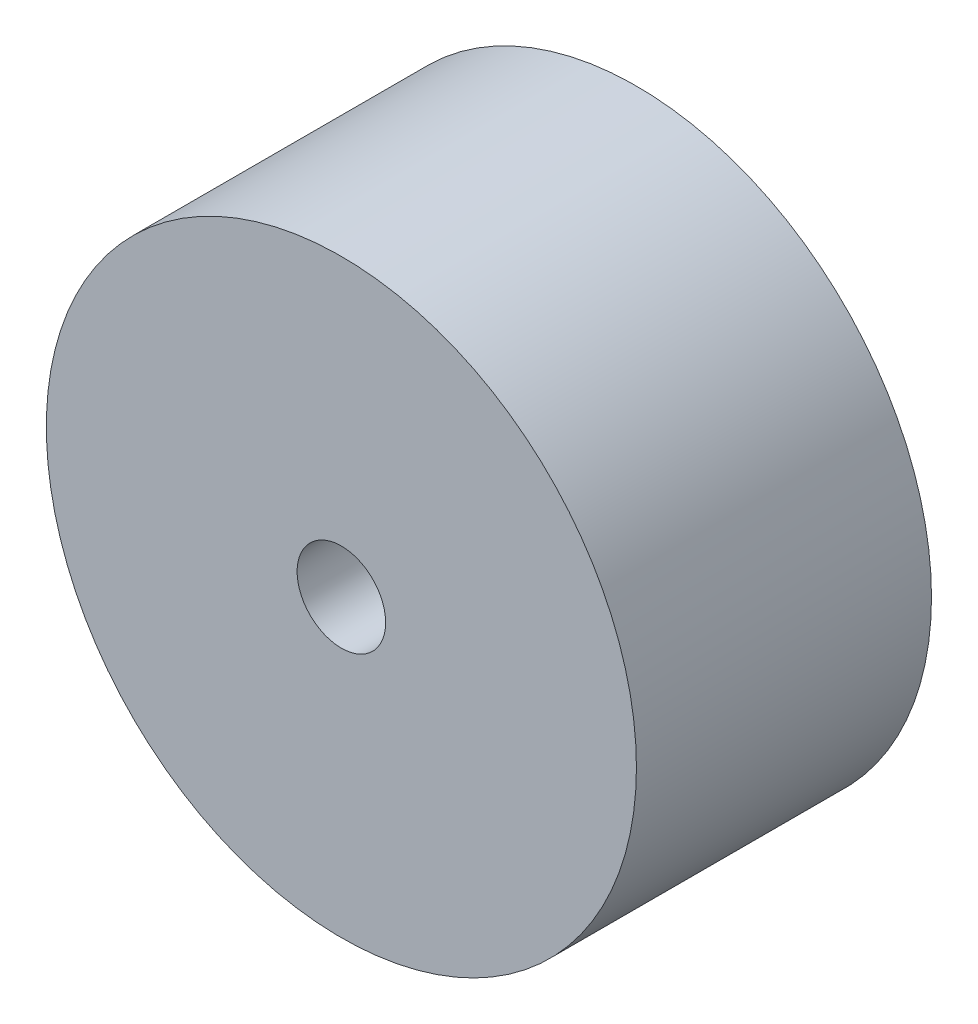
ISO-10303-21;
HEADER;
FILE_DESCRIPTION(('STEP AP214'),'2;1');
FILE_NAME('part.step','',(''),(''),'','','');
FILE_SCHEMA(('AUTOMOTIVE_DESIGN { 1 0 10303 214 1 1 1 1 }'));
ENDSEC;
DATA;
#1=APPLICATION_CONTEXT('core data for automotive mechanical design processes');
#2=APPLICATION_PROTOCOL_DEFINITION('international standard','automotive_design',2000,#1);
#3=PRODUCT_CONTEXT('',#1,'mechanical');
#4=PRODUCT('Part','Part','',(#3));
#5=PRODUCT_RELATED_PRODUCT_CATEGORY('part','',(#4));
#6=PRODUCT_DEFINITION_FORMATION('','',#4);
#7=PRODUCT_DEFINITION_CONTEXT('part definition',#1,'design');
#8=PRODUCT_DEFINITION('design','',#6,#7);
#9=PRODUCT_DEFINITION_SHAPE('','',#8);
#10=(LENGTH_UNIT() NAMED_UNIT(*) SI_UNIT(.MILLI.,.METRE.));
#11=(NAMED_UNIT(*) PLANE_ANGLE_UNIT() SI_UNIT($,.RADIAN.));
#12=(NAMED_UNIT(*) SI_UNIT($,.STERADIAN.) SOLID_ANGLE_UNIT());
#13=UNCERTAINTY_MEASURE_WITH_UNIT(LENGTH_MEASURE(1.E-05),#10,'distance_accuracy_value','');
#14=(GEOMETRIC_REPRESENTATION_CONTEXT(3) GLOBAL_UNCERTAINTY_ASSIGNED_CONTEXT((#13)) GLOBAL_UNIT_ASSIGNED_CONTEXT((#10,
#11,#12)) REPRESENTATION_CONTEXT('',''));
#15=CARTESIAN_POINT('',(0.,0.,0.));
#16=DIRECTION('',(0.,0.,1.));
#17=DIRECTION('',(1.,0.,0.));
#18=AXIS2_PLACEMENT_3D('',#15,#16,#17);
#19=CARTESIAN_POINT('',(0.,0.,20.));
#20=DIRECTION('',(0.,0.,-1.));
#21=DIRECTION('',(-1.,0.,0.));
#22=AXIS2_PLACEMENT_3D('',#19,#20,#21);
#23=CYLINDRICAL_SURFACE('',#22,20.);
#24=CARTESIAN_POINT('',(0.,0.,20.));
#25=DIRECTION('',(0.,0.,1.));
#26=DIRECTION('',(1.,0.,0.));
#27=AXIS2_PLACEMENT_3D('',#24,#25,#26);
#28=CIRCLE('',#27,20.);
#29=CARTESIAN_POINT('',(20.,0.,20.));
#30=VERTEX_POINT('',#29);
#31=EDGE_CURVE('E10',#30,#30,#28,.T.);
#32=ORIENTED_EDGE('',*,*,#31,.F.);
#33=EDGE_LOOP('',(#32));
#34=FACE_BOUND('',#33,.T.);
#35=CARTESIAN_POINT('',(0.,0.,0.));
#36=DIRECTION('',(0.,0.,1.));
#37=DIRECTION('',(1.,0.,0.));
#38=AXIS2_PLACEMENT_3D('',#35,#36,#37);
#39=CIRCLE('',#38,20.);
#40=CARTESIAN_POINT('',(20.,0.,0.));
#41=VERTEX_POINT('',#40);
#42=EDGE_CURVE('E32',#41,#41,#39,.T.);
#43=ORIENTED_EDGE('',*,*,#42,.T.);
#44=EDGE_LOOP('',(#43));
#45=FACE_BOUND('',#44,.T.);
#46=ADVANCED_FACE('F29',(#34,#45),#23,.T.);
#47=CARTESIAN_POINT('',(0.,0.,20.));
#48=DIRECTION('',(0.,0.,1.));
#49=DIRECTION('',(1.,0.,0.));
#50=AXIS2_PLACEMENT_3D('',#47,#48,#49);
#51=PLANE('',#50);
#52=CARTESIAN_POINT('',(0.,0.,20.));
#53=DIRECTION('',(0.,0.,1.));
#54=DIRECTION('',(1.,0.,0.));
#55=AXIS2_PLACEMENT_3D('',#52,#53,#54);
#56=CIRCLE('',#55,3.);
#57=CARTESIAN_POINT('',(3.,0.,20.));
#58=VERTEX_POINT('',#57);
#59=EDGE_CURVE('E41',#58,#58,#56,.T.);
#60=ORIENTED_EDGE('',*,*,#59,.F.);
#61=EDGE_LOOP('',(#60));
#62=FACE_BOUND('',#61,.T.);
#63=ORIENTED_EDGE('',*,*,#31,.T.);
#64=EDGE_LOOP('',(#63));
#65=FACE_BOUND('',#64,.T.);
#66=ADVANCED_FACE('F56',(#62,#65),#51,.T.);
#67=CARTESIAN_POINT('',(0.,0.,0.));
#68=DIRECTION('',(0.,0.,1.));
#69=DIRECTION('',(1.,0.,0.));
#70=AXIS2_PLACEMENT_3D('',#67,#68,#69);
#71=PLANE('',#70);
#72=ORIENTED_EDGE('',*,*,#42,.F.);
#73=EDGE_LOOP('',(#72));
#74=FACE_BOUND('',#73,.T.);
#75=ADVANCED_FACE('F52',(#74),#71,.F.);
#76=CARTESIAN_POINT('',(0.,0.,13.));
#77=DIRECTION('',(0.,0.,1.));
#78=DIRECTION('',(1.,0.,0.));
#79=AXIS2_PLACEMENT_3D('',#76,#77,#78);
#80=CYLINDRICAL_SURFACE('',#79,3.);
#81=CARTESIAN_POINT('',(0.,0.,13.));
#82=DIRECTION('',(0.,0.,1.));
#83=DIRECTION('',(1.,0.,0.));
#84=AXIS2_PLACEMENT_3D('',#81,#82,#83);
#85=CIRCLE('',#84,3.);
#86=CARTESIAN_POINT('',(3.,0.,13.));
#87=VERTEX_POINT('',#86);
#88=EDGE_CURVE('E39',#87,#87,#85,.T.);
#89=ORIENTED_EDGE('',*,*,#88,.F.);
#90=EDGE_LOOP('',(#89));
#91=FACE_BOUND('',#90,.T.);
#92=ORIENTED_EDGE('',*,*,#59,.T.);
#93=EDGE_LOOP('',(#92));
#94=FACE_BOUND('',#93,.T.);
#95=ADVANCED_FACE('F49',(#91,#94),#80,.F.);
#96=CARTESIAN_POINT('',(0.,0.,13.));
#97=DIRECTION('',(0.,0.,1.));
#98=DIRECTION('',(1.,0.,0.));
#99=AXIS2_PLACEMENT_3D('',#96,#97,#98);
#100=PLANE('',#99);
#101=ORIENTED_EDGE('',*,*,#88,.T.);
#102=EDGE_LOOP('',(#101));
#103=FACE_BOUND('',#102,.T.);
#104=ADVANCED_FACE('F47',(#103),#100,.T.);
#105=CLOSED_SHELL('',(#46,#66,#75,#95,#104));
#106=MANIFOLD_SOLID_BREP('B2',#105);
#107=ADVANCED_BREP_SHAPE_REPRESENTATION('',(#18,#106),#14);
#108=SHAPE_DEFINITION_REPRESENTATION(#9,#107);
ENDSEC;
END-ISO-10303-21;
